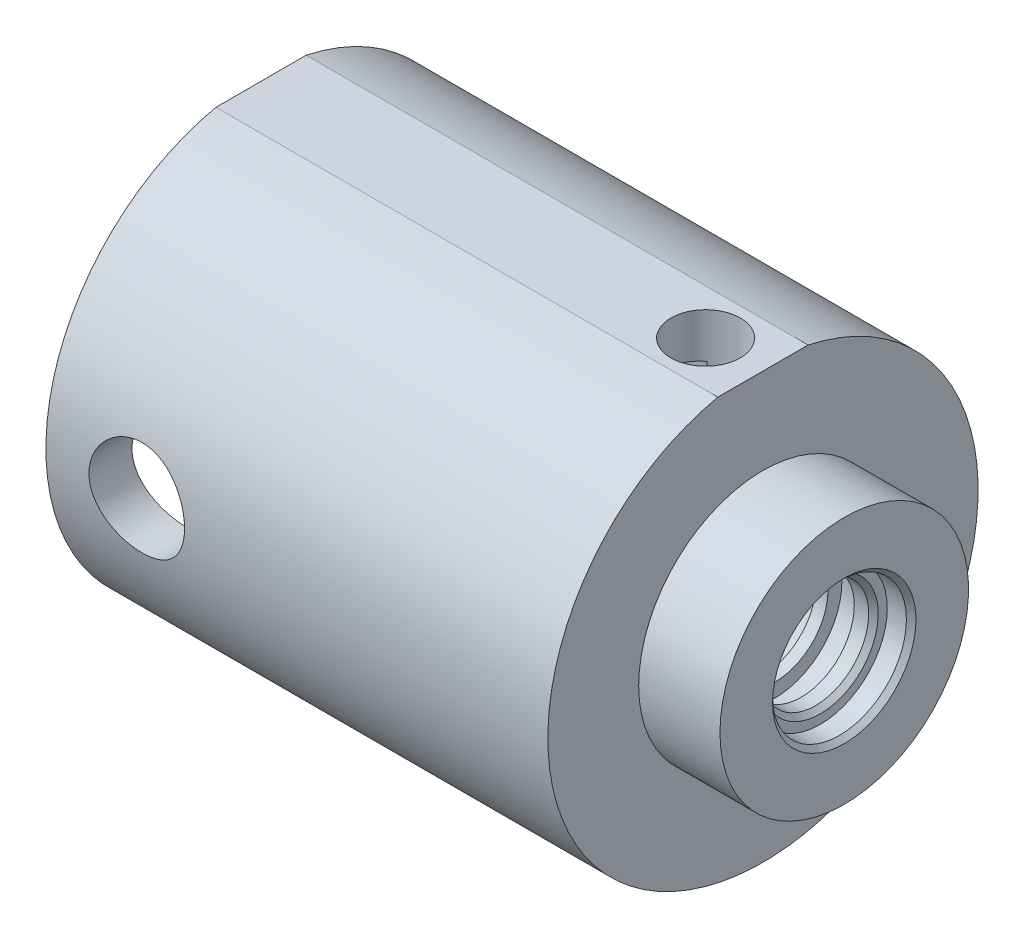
from build123d import *

# Parameters (mm, degrees)
CHANFREIN1_SIZE              = 1
ESQUISSE4_W                  = 132.217663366
ESQUISSE4_H                  = 30.780831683
ENL_V_MAT_EXTRU_1_DEPTH      = 123.780291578
TROU_TARAUD_G3_8_D           = 14.5
TROU_TARAUD_G3_8_DEPTH       = 22.5
TROU_TARAUD_G3_8_TIP         = 4.356239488
ENL_V_MAT_EXTRU_2_DEPTH      = 138.60087209
ENL_V_MAT_EXTRU_2_DEPTH_BACK = 138.60087209
ESQUISSE7_R                  = 10


with BuildPart() as part:
    # Esquisse1 → R_volution1 (revolve)
    with BuildSketch(Plane.XY, mode=Mode.PRIVATE) as r_volution1_sk:
        Polygon((0, 0), (0, 45), (105, 45), (105, 26), (122, 26), (122, 0), align=None)
    revolve(r_volution1_sk.sketch.rotate(Axis((0, 0, 0), (1, 0, 0)), 90), axis=Axis((0, 0, 0), (1, 0, 0)))

    # Esquisse2 → Enl_vement de mati_re-R_volution1 (revolve, cut)
    with BuildSketch(Plane.XY, mode=Mode.PRIVATE) as enl_vement_de_mati_re_r_volution1_sk:
        Polygon((0, 0), (0, 36), (3, 36), (3, 37.5), (7, 37.5), (7, 36), (32, 36), (34.747477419, 35), (88, 35), (88, 11.1), (89.8, 11.1), (89.8, 13), (105, 13), (105, 11.1), (107.5, 11.1), (107.5, 14), (113, 14), (113, 11.1), (117, 11.1), (117, 14), (122, 14), (122, 0), align=None)
    revolve(enl_vement_de_mati_re_r_volution1_sk.sketch.rotate(Axis((122, 0, 0), (-1, 0, 0)), 90), axis=Axis((122, 0, 0), (-1, 0, 0)), mode=Mode.SUBTRACT)

    # Chanfrein1
    chanfrein1_edges = [part.edges().sort_by_distance(p)[0] for p in [
        (117, 0, 11.1),
        (122, 0, 14),
    ]]
    chamfer(chanfrein1_edges, length=CHANFREIN1_SIZE)

    # Esquisse4 → Enl_v. mat.-Extru.1 (cut, through all)
    with BuildSketch(Plane(origin=(105, 0, 0), x_dir=(0, 0, -1), z_dir=(1, 0, 0))):
        with Locations((6.121188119, 59.390415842)):
            Rectangle(ESQUISSE4_W, ESQUISSE4_H)
    extrude(amount=-ENL_V_MAT_EXTRU_1_DEPTH, mode=Mode.SUBTRACT)

    # Trou taraud_ G3_8
    with Locations(Plane(origin=(0, 44, 0), x_dir=(-1, 0, 0), z_dir=(0, 1, 0))):
        with Locations((-93, 0)):
            Hole(TROU_TARAUD_G3_8_D / 2, depth=TROU_TARAUD_G3_8_DEPTH)
            with Locations((0, 0, -(TROU_TARAUD_G3_8_DEPTH + TROU_TARAUD_G3_8_TIP / 2))):  # 118° drill point
                Cone(0, TROU_TARAUD_G3_8_D / 2, TROU_TARAUD_G3_8_TIP, mode=Mode.SUBTRACT)

    # Esquisse7 → Enl_v. mat.-Extru.2 (cut, two sides: drawn at the far end of the back side and taken through both)
    with BuildSketch(Plane.XY.offset(-ENL_V_MAT_EXTRU_2_DEPTH_BACK)):
        with Locations((19, 0)):
            Circle(ESQUISSE7_R)
    extrude(amount=ENL_V_MAT_EXTRU_2_DEPTH + ENL_V_MAT_EXTRU_2_DEPTH_BACK, mode=Mode.SUBTRACT)


solid = part.part
